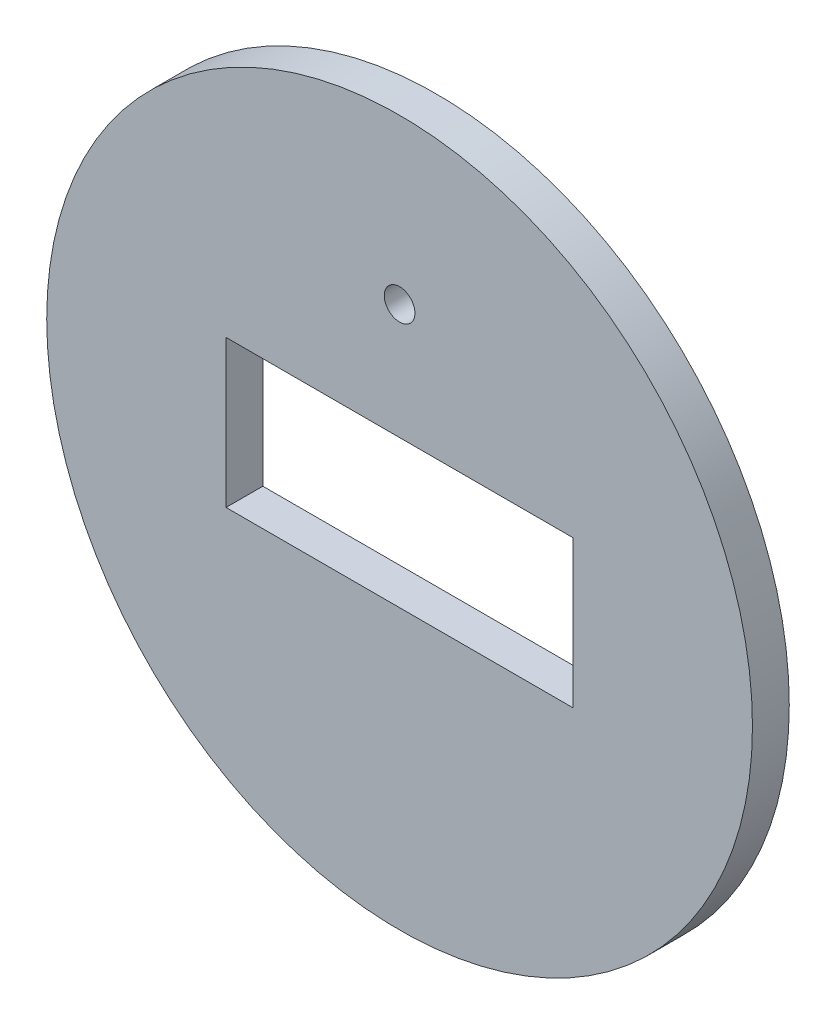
ISO-10303-21;
HEADER;
FILE_DESCRIPTION(('STEP AP214'),'2;1');
FILE_NAME('part.step','',(''),(''),'','','');
FILE_SCHEMA(('AUTOMOTIVE_DESIGN { 1 0 10303 214 1 1 1 1 }'));
ENDSEC;
DATA;
#1=APPLICATION_CONTEXT('core data for automotive mechanical design processes');
#2=APPLICATION_PROTOCOL_DEFINITION('international standard','automotive_design',2000,#1);
#3=PRODUCT_CONTEXT('',#1,'mechanical');
#4=PRODUCT('Part','Part','',(#3));
#5=PRODUCT_RELATED_PRODUCT_CATEGORY('part','',(#4));
#6=PRODUCT_DEFINITION_FORMATION('','',#4);
#7=PRODUCT_DEFINITION_CONTEXT('part definition',#1,'design');
#8=PRODUCT_DEFINITION('design','',#6,#7);
#9=PRODUCT_DEFINITION_SHAPE('','',#8);
#10=(LENGTH_UNIT() NAMED_UNIT(*) SI_UNIT(.MILLI.,.METRE.));
#11=(NAMED_UNIT(*) PLANE_ANGLE_UNIT() SI_UNIT($,.RADIAN.));
#12=(NAMED_UNIT(*) SI_UNIT($,.STERADIAN.) SOLID_ANGLE_UNIT());
#13=UNCERTAINTY_MEASURE_WITH_UNIT(LENGTH_MEASURE(1.E-05),#10,'distance_accuracy_value','');
#14=(GEOMETRIC_REPRESENTATION_CONTEXT(3) GLOBAL_UNCERTAINTY_ASSIGNED_CONTEXT((#13)) GLOBAL_UNIT_ASSIGNED_CONTEXT((#10,
#11,#12)) REPRESENTATION_CONTEXT('',''));
#15=CARTESIAN_POINT('',(0.,0.,0.));
#16=DIRECTION('',(0.,0.,1.));
#17=DIRECTION('',(1.,0.,0.));
#18=AXIS2_PLACEMENT_3D('',#15,#16,#17);
#19=CARTESIAN_POINT('',(0.,0.,3.81));
#20=DIRECTION('',(0.,0.,1.));
#21=DIRECTION('',(1.,0.,0.));
#22=AXIS2_PLACEMENT_3D('',#19,#20,#21);
#23=PLANE('',#22);
#24=CARTESIAN_POINT('',(0.,19.558,3.81));
#25=DIRECTION('',(0.,0.,1.));
#26=DIRECTION('',(1.,0.,0.));
#27=AXIS2_PLACEMENT_3D('',#24,#25,#26);
#28=CIRCLE('',#27,1.5875);
#29=CARTESIAN_POINT('',(-1.5875,19.558,3.81));
#30=VERTEX_POINT('',#29);
#31=EDGE_CURVE('E110',#30,#30,#28,.T.);
#32=ORIENTED_EDGE('',*,*,#31,.F.);
#33=EDGE_LOOP('',(#32));
#34=FACE_BOUND('',#33,.T.);
#35=CARTESIAN_POINT('',(0.,0.,3.81));
#36=DIRECTION('',(0.,0.,1.));
#37=DIRECTION('',(1.,0.,0.));
#38=AXIS2_PLACEMENT_3D('',#35,#36,#37);
#39=CIRCLE('',#38,36.5125);
#40=CARTESIAN_POINT('',(-36.5125,0.,3.81));
#41=VERTEX_POINT('',#40);
#42=EDGE_CURVE('E11',#41,#41,#39,.T.);
#43=ORIENTED_EDGE('',*,*,#42,.T.);
#44=EDGE_LOOP('',(#43));
#45=FACE_BOUND('',#44,.T.);
#46=DIRECTION('',(1.,0.,0.));
#47=VECTOR('',#46,1.);
#48=CARTESIAN_POINT('',(17.9578,-7.62,3.81));
#49=LINE('',#48,#47);
#50=CARTESIAN_POINT('',(-17.9578,-7.62,3.81));
#51=VERTEX_POINT('',#50);
#52=CARTESIAN_POINT('',(17.9578,-7.62,3.81));
#53=VERTEX_POINT('',#52);
#54=EDGE_CURVE('E98',#51,#53,#49,.T.);
#55=ORIENTED_EDGE('',*,*,#54,.F.);
#56=DIRECTION('',(0.,-1.,0.));
#57=VECTOR('',#56,1.);
#58=CARTESIAN_POINT('',(-17.9578,7.62,3.81));
#59=LINE('',#58,#57);
#60=CARTESIAN_POINT('',(-17.9578,7.62,3.81));
#61=VERTEX_POINT('',#60);
#62=EDGE_CURVE('E87',#61,#51,#59,.T.);
#63=ORIENTED_EDGE('',*,*,#62,.F.);
#64=DIRECTION('',(-1.,0.,0.));
#65=VECTOR('',#64,1.);
#66=CARTESIAN_POINT('',(-17.9578,7.62,3.81));
#67=LINE('',#66,#65);
#68=CARTESIAN_POINT('',(17.9578,7.62,3.81));
#69=VERTEX_POINT('',#68);
#70=EDGE_CURVE('E102',#69,#61,#67,.T.);
#71=ORIENTED_EDGE('',*,*,#70,.F.);
#72=DIRECTION('',(0.,1.,0.));
#73=VECTOR('',#72,1.);
#74=CARTESIAN_POINT('',(17.9578,7.62,3.81));
#75=LINE('',#74,#73);
#76=EDGE_CURVE('E100',#53,#69,#75,.T.);
#77=ORIENTED_EDGE('',*,*,#76,.F.);
#78=EDGE_LOOP('',(#55,#63,#71,#77));
#79=FACE_BOUND('',#78,.T.);
#80=ADVANCED_FACE('F31',(#34,#45,#79),#23,.T.);
#81=CARTESIAN_POINT('',(0.,0.,0.));
#82=DIRECTION('',(0.,0.,1.));
#83=DIRECTION('',(1.,0.,0.));
#84=AXIS2_PLACEMENT_3D('',#81,#82,#83);
#85=PLANE('',#84);
#86=CARTESIAN_POINT('',(0.,19.558,0.));
#87=DIRECTION('',(0.,0.,1.));
#88=DIRECTION('',(1.,0.,0.));
#89=AXIS2_PLACEMENT_3D('',#86,#87,#88);
#90=CIRCLE('',#89,1.5875);
#91=CARTESIAN_POINT('',(-1.5875,19.558,0.));
#92=VERTEX_POINT('',#91);
#93=EDGE_CURVE('E88',#92,#92,#90,.T.);
#94=ORIENTED_EDGE('',*,*,#93,.T.);
#95=EDGE_LOOP('',(#94));
#96=FACE_BOUND('',#95,.T.);
#97=CARTESIAN_POINT('',(0.,0.,0.));
#98=DIRECTION('',(0.,0.,1.));
#99=DIRECTION('',(1.,0.,0.));
#100=AXIS2_PLACEMENT_3D('',#97,#98,#99);
#101=CIRCLE('',#100,36.5125);
#102=CARTESIAN_POINT('',(-36.5125,0.,0.));
#103=VERTEX_POINT('',#102);
#104=EDGE_CURVE('E39',#103,#103,#101,.T.);
#105=ORIENTED_EDGE('',*,*,#104,.F.);
#106=EDGE_LOOP('',(#105));
#107=FACE_BOUND('',#106,.T.);
#108=DIRECTION('',(0.,-1.,0.));
#109=VECTOR('',#108,1.);
#110=CARTESIAN_POINT('',(-17.9578,7.62,0.));
#111=LINE('',#110,#109);
#112=CARTESIAN_POINT('',(-17.9578,7.62,0.));
#113=VERTEX_POINT('',#112);
#114=CARTESIAN_POINT('',(-17.9578,-7.62,0.));
#115=VERTEX_POINT('',#114);
#116=EDGE_CURVE('E54',#113,#115,#111,.T.);
#117=ORIENTED_EDGE('',*,*,#116,.T.);
#118=DIRECTION('',(1.,0.,0.));
#119=VECTOR('',#118,1.);
#120=CARTESIAN_POINT('',(17.9578,-7.62,0.));
#121=LINE('',#120,#119);
#122=CARTESIAN_POINT('',(17.9578,-7.62,0.));
#123=VERTEX_POINT('',#122);
#124=EDGE_CURVE('E74',#115,#123,#121,.T.);
#125=ORIENTED_EDGE('',*,*,#124,.T.);
#126=DIRECTION('',(0.,1.,0.));
#127=VECTOR('',#126,1.);
#128=CARTESIAN_POINT('',(17.9578,7.62,0.));
#129=LINE('',#128,#127);
#130=CARTESIAN_POINT('',(17.9578,7.62,0.));
#131=VERTEX_POINT('',#130);
#132=EDGE_CURVE('E83',#123,#131,#129,.T.);
#133=ORIENTED_EDGE('',*,*,#132,.T.);
#134=DIRECTION('',(-1.,0.,0.));
#135=VECTOR('',#134,1.);
#136=CARTESIAN_POINT('',(-17.9578,7.62,0.));
#137=LINE('',#136,#135);
#138=EDGE_CURVE('E92',#131,#113,#137,.T.);
#139=ORIENTED_EDGE('',*,*,#138,.T.);
#140=EDGE_LOOP('',(#117,#125,#133,#139));
#141=FACE_BOUND('',#140,.T.);
#142=ADVANCED_FACE('F91',(#96,#107,#141),#85,.F.);
#143=CARTESIAN_POINT('',(0.,0.,3.81));
#144=DIRECTION('',(0.,0.,-1.));
#145=DIRECTION('',(-1.,0.,0.));
#146=AXIS2_PLACEMENT_3D('',#143,#144,#145);
#147=CYLINDRICAL_SURFACE('',#146,36.5125);
#148=CARTESIAN_POINT('',(-36.5125,0.,3.81));
#149=CARTESIAN_POINT('',(-36.5125,0.,3.7703125));
#150=CARTESIAN_POINT('',(-36.5125,0.,3.730625));
#151=CARTESIAN_POINT('',(-36.5125,0.,3.65125));
#152=CARTESIAN_POINT('',(-36.5125,0.,3.6115625));
#153=CARTESIAN_POINT('',(-36.5125,0.,3.5321875));
#154=CARTESIAN_POINT('',(-36.5125,0.,3.4925));
#155=CARTESIAN_POINT('',(-36.5125,0.,3.413125));
#156=CARTESIAN_POINT('',(-36.5125,0.,3.3734375));
#157=CARTESIAN_POINT('',(-36.5125,0.,3.2940625));
#158=CARTESIAN_POINT('',(-36.5125,0.,3.254375));
#159=CARTESIAN_POINT('',(-36.5125,0.,3.175));
#160=CARTESIAN_POINT('',(-36.5125,0.,3.1353125));
#161=CARTESIAN_POINT('',(-36.5125,0.,3.0559375));
#162=CARTESIAN_POINT('',(-36.5125,0.,3.01625));
#163=CARTESIAN_POINT('',(-36.5125,0.,2.936875));
#164=CARTESIAN_POINT('',(-36.5125,0.,2.8971875));
#165=CARTESIAN_POINT('',(-36.5125,0.,2.8178125));
#166=CARTESIAN_POINT('',(-36.5125,0.,2.778125));
#167=CARTESIAN_POINT('',(-36.5125,0.,2.69875));
#168=CARTESIAN_POINT('',(-36.5125,0.,2.6590625));
#169=CARTESIAN_POINT('',(-36.5125,0.,2.5796875));
#170=CARTESIAN_POINT('',(-36.5125,0.,2.54));
#171=CARTESIAN_POINT('',(-36.5125,0.,2.460625));
#172=CARTESIAN_POINT('',(-36.5125,0.,2.4209375));
#173=CARTESIAN_POINT('',(-36.5125,0.,2.3415625));
#174=CARTESIAN_POINT('',(-36.5125,0.,2.301875));
#175=CARTESIAN_POINT('',(-36.5125,0.,2.2225));
#176=CARTESIAN_POINT('',(-36.5125,0.,2.1828125));
#177=CARTESIAN_POINT('',(-36.5125,0.,2.1034375));
#178=CARTESIAN_POINT('',(-36.5125,0.,2.06375));
#179=CARTESIAN_POINT('',(-36.5125,0.,1.984375));
#180=CARTESIAN_POINT('',(-36.5125,0.,1.9446875));
#181=CARTESIAN_POINT('',(-36.5125,0.,1.8653125));
#182=CARTESIAN_POINT('',(-36.5125,0.,1.825625));
#183=CARTESIAN_POINT('',(-36.5125,0.,1.74625));
#184=CARTESIAN_POINT('',(-36.5125,0.,1.7065625));
#185=CARTESIAN_POINT('',(-36.5125,0.,1.6271875));
#186=CARTESIAN_POINT('',(-36.5125,0.,1.5875));
#187=CARTESIAN_POINT('',(-36.5125,0.,1.508125));
#188=CARTESIAN_POINT('',(-36.5125,0.,1.4684375));
#189=CARTESIAN_POINT('',(-36.5125,0.,1.3890625));
#190=CARTESIAN_POINT('',(-36.5125,0.,1.349375));
#191=CARTESIAN_POINT('',(-36.5125,0.,1.27));
#192=CARTESIAN_POINT('',(-36.5125,0.,1.2303125));
#193=CARTESIAN_POINT('',(-36.5125,0.,1.1509375));
#194=CARTESIAN_POINT('',(-36.5125,0.,1.11125));
#195=CARTESIAN_POINT('',(-36.5125,0.,1.031875));
#196=CARTESIAN_POINT('',(-36.5125,0.,0.9921875));
#197=CARTESIAN_POINT('',(-36.5125,0.,0.9128125));
#198=CARTESIAN_POINT('',(-36.5125,0.,0.873125));
#199=CARTESIAN_POINT('',(-36.5125,0.,0.79375));
#200=CARTESIAN_POINT('',(-36.5125,0.,0.7540625));
#201=CARTESIAN_POINT('',(-36.5125,0.,0.6746875));
#202=CARTESIAN_POINT('',(-36.5125,0.,0.635));
#203=CARTESIAN_POINT('',(-36.5125,0.,0.555625));
#204=CARTESIAN_POINT('',(-36.5125,0.,0.5159375));
#205=CARTESIAN_POINT('',(-36.5125,0.,0.4365625));
#206=CARTESIAN_POINT('',(-36.5125,0.,0.396875));
#207=CARTESIAN_POINT('',(-36.5125,0.,0.3175));
#208=CARTESIAN_POINT('',(-36.5125,0.,0.2778125));
#209=CARTESIAN_POINT('',(-36.5125,0.,0.1984375));
#210=CARTESIAN_POINT('',(-36.5125,0.,0.15875));
#211=CARTESIAN_POINT('',(-36.5125,0.,0.0793749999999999));
#212=CARTESIAN_POINT('',(-36.5125,0.,0.0396874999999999));
#213=CARTESIAN_POINT('',(-36.5125,0.,0.));
#214=B_SPLINE_CURVE_WITH_KNOTS('',3,(#148,#149,#150,#151,#152,#153,#154,#155,#156,#157,#158,
#159,#160,#161,#162,#163,#164,#165,#166,#167,#168,#169,#170,#171,#172,#173,#174,#175,#176,#177,
#178,#179,#180,#181,#182,#183,#184,#185,#186,#187,#188,#189,#190,#191,#192,#193,#194,#195,#196,
#197,#198,#199,#200,#201,#202,#203,#204,#205,#206,#207,#208,#209,#210,#211,#212,#213),
.UNSPECIFIED.,.F.,.F.,(4,2,2,2,2,2,2,2,2,2,2,2,2,2,2,2,2,2,2,2,2,2,2,2,2,2,2,2,2,2,2,2,4),(0.,
0.1190625,0.238125,0.3571875,0.47625,0.5953125,0.714375,0.8334375,0.9525,1.0715625,1.190625,
1.3096875,1.42875,1.5478125,1.666875,1.7859375,1.905,2.0240625,2.143125,2.2621875,2.38125,
2.5003125,2.619375,2.7384375,2.8575,2.9765625,3.095625,3.2146875,3.33375,3.4528125,3.571875,
3.6909375,3.81),.UNSPECIFIED.);
#215=EDGE_CURVE('BSEAM33',#41,#103,#214,.T.);
#216=ORIENTED_EDGE('',*,*,#42,.F.);
#217=ORIENTED_EDGE('',*,*,#104,.T.);
#218=ORIENTED_EDGE('',*,*,#215,.T.);
#219=ORIENTED_EDGE('',*,*,#215,.F.);
#220=EDGE_LOOP('',(#216,#218,#217,#219));
#221=FACE_BOUND('',#220,.T.);
#222=ADVANCED_FACE('F33',(#221),#147,.T.);
#223=CARTESIAN_POINT('',(0.,19.558,3.81));
#224=DIRECTION('',(0.,0.,-1.));
#225=DIRECTION('',(-1.,0.,0.));
#226=AXIS2_PLACEMENT_3D('',#223,#224,#225);
#227=CYLINDRICAL_SURFACE('',#226,1.5875);
#228=CARTESIAN_POINT('',(-1.5875,19.558,3.81));
#229=CARTESIAN_POINT('',(-1.5875,19.558,3.7703125));
#230=CARTESIAN_POINT('',(-1.5875,19.558,3.730625));
#231=CARTESIAN_POINT('',(-1.5875,19.558,3.65125));
#232=CARTESIAN_POINT('',(-1.5875,19.558,3.6115625));
#233=CARTESIAN_POINT('',(-1.5875,19.558,3.5321875));
#234=CARTESIAN_POINT('',(-1.5875,19.558,3.4925));
#235=CARTESIAN_POINT('',(-1.5875,19.558,3.413125));
#236=CARTESIAN_POINT('',(-1.5875,19.558,3.3734375));
#237=CARTESIAN_POINT('',(-1.5875,19.558,3.2940625));
#238=CARTESIAN_POINT('',(-1.5875,19.558,3.254375));
#239=CARTESIAN_POINT('',(-1.5875,19.558,3.175));
#240=CARTESIAN_POINT('',(-1.5875,19.558,3.1353125));
#241=CARTESIAN_POINT('',(-1.5875,19.558,3.0559375));
#242=CARTESIAN_POINT('',(-1.5875,19.558,3.01625));
#243=CARTESIAN_POINT('',(-1.5875,19.558,2.936875));
#244=CARTESIAN_POINT('',(-1.5875,19.558,2.8971875));
#245=CARTESIAN_POINT('',(-1.5875,19.558,2.8178125));
#246=CARTESIAN_POINT('',(-1.5875,19.558,2.778125));
#247=CARTESIAN_POINT('',(-1.5875,19.558,2.69875));
#248=CARTESIAN_POINT('',(-1.5875,19.558,2.6590625));
#249=CARTESIAN_POINT('',(-1.5875,19.558,2.5796875));
#250=CARTESIAN_POINT('',(-1.5875,19.558,2.54));
#251=CARTESIAN_POINT('',(-1.5875,19.558,2.460625));
#252=CARTESIAN_POINT('',(-1.5875,19.558,2.4209375));
#253=CARTESIAN_POINT('',(-1.5875,19.558,2.3415625));
#254=CARTESIAN_POINT('',(-1.5875,19.558,2.301875));
#255=CARTESIAN_POINT('',(-1.5875,19.558,2.2225));
#256=CARTESIAN_POINT('',(-1.5875,19.558,2.1828125));
#257=CARTESIAN_POINT('',(-1.5875,19.558,2.1034375));
#258=CARTESIAN_POINT('',(-1.5875,19.558,2.06375));
#259=CARTESIAN_POINT('',(-1.5875,19.558,1.984375));
#260=CARTESIAN_POINT('',(-1.5875,19.558,1.9446875));
#261=CARTESIAN_POINT('',(-1.5875,19.558,1.8653125));
#262=CARTESIAN_POINT('',(-1.5875,19.558,1.825625));
#263=CARTESIAN_POINT('',(-1.5875,19.558,1.74625));
#264=CARTESIAN_POINT('',(-1.5875,19.558,1.7065625));
#265=CARTESIAN_POINT('',(-1.5875,19.558,1.6271875));
#266=CARTESIAN_POINT('',(-1.5875,19.558,1.5875));
#267=CARTESIAN_POINT('',(-1.5875,19.558,1.508125));
#268=CARTESIAN_POINT('',(-1.5875,19.558,1.4684375));
#269=CARTESIAN_POINT('',(-1.5875,19.558,1.3890625));
#270=CARTESIAN_POINT('',(-1.5875,19.558,1.349375));
#271=CARTESIAN_POINT('',(-1.5875,19.558,1.27));
#272=CARTESIAN_POINT('',(-1.5875,19.558,1.2303125));
#273=CARTESIAN_POINT('',(-1.5875,19.558,1.1509375));
#274=CARTESIAN_POINT('',(-1.5875,19.558,1.11125));
#275=CARTESIAN_POINT('',(-1.5875,19.558,1.031875));
#276=CARTESIAN_POINT('',(-1.5875,19.558,0.9921875));
#277=CARTESIAN_POINT('',(-1.5875,19.558,0.9128125));
#278=CARTESIAN_POINT('',(-1.5875,19.558,0.873125));
#279=CARTESIAN_POINT('',(-1.5875,19.558,0.79375));
#280=CARTESIAN_POINT('',(-1.5875,19.558,0.7540625));
#281=CARTESIAN_POINT('',(-1.5875,19.558,0.6746875));
#282=CARTESIAN_POINT('',(-1.5875,19.558,0.635));
#283=CARTESIAN_POINT('',(-1.5875,19.558,0.555625));
#284=CARTESIAN_POINT('',(-1.5875,19.558,0.5159375));
#285=CARTESIAN_POINT('',(-1.5875,19.558,0.4365625));
#286=CARTESIAN_POINT('',(-1.5875,19.558,0.396875));
#287=CARTESIAN_POINT('',(-1.5875,19.558,0.3175));
#288=CARTESIAN_POINT('',(-1.5875,19.558,0.2778125));
#289=CARTESIAN_POINT('',(-1.5875,19.558,0.1984375));
#290=CARTESIAN_POINT('',(-1.5875,19.558,0.15875));
#291=CARTESIAN_POINT('',(-1.5875,19.558,0.0793749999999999));
#292=CARTESIAN_POINT('',(-1.5875,19.558,0.0396874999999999));
#293=CARTESIAN_POINT('',(-1.5875,19.558,0.));
#294=B_SPLINE_CURVE_WITH_KNOTS('',3,(#228,#229,#230,#231,#232,#233,#234,#235,#236,#237,#238,
#239,#240,#241,#242,#243,#244,#245,#246,#247,#248,#249,#250,#251,#252,#253,#254,#255,#256,#257,
#258,#259,#260,#261,#262,#263,#264,#265,#266,#267,#268,#269,#270,#271,#272,#273,#274,#275,#276,
#277,#278,#279,#280,#281,#282,#283,#284,#285,#286,#287,#288,#289,#290,#291,#292,#293),
.UNSPECIFIED.,.F.,.F.,(4,2,2,2,2,2,2,2,2,2,2,2,2,2,2,2,2,2,2,2,2,2,2,2,2,2,2,2,2,2,2,2,4),(0.,
0.1190625,0.238125,0.3571875,0.47625,0.5953125,0.714375,0.8334375,0.9525,1.0715625,1.190625,
1.3096875,1.42875,1.5478125,1.666875,1.7859375,1.905,2.0240625,2.143125,2.2621875,2.38125,
2.5003125,2.619375,2.7384375,2.8575,2.9765625,3.095625,3.2146875,3.33375,3.4528125,3.571875,
3.6909375,3.81),.UNSPECIFIED.);
#295=EDGE_CURVE('BSEAM123',#30,#92,#294,.T.);
#296=ORIENTED_EDGE('',*,*,#31,.T.);
#297=ORIENTED_EDGE('',*,*,#93,.F.);
#298=ORIENTED_EDGE('',*,*,#295,.T.);
#299=ORIENTED_EDGE('',*,*,#295,.F.);
#300=EDGE_LOOP('',(#296,#298,#297,#299));
#301=FACE_BOUND('',#300,.T.);
#302=ADVANCED_FACE('F123',(#301),#227,.F.);
#303=CARTESIAN_POINT('',(-17.9578,7.62,3.81));
#304=DIRECTION('',(1.,0.,0.));
#305=DIRECTION('',(0.,1.,0.));
#306=AXIS2_PLACEMENT_3D('',#303,#304,#305);
#307=PLANE('',#306);
#308=ORIENTED_EDGE('',*,*,#116,.F.);
#309=DIRECTION('',(0.,0.,-1.));
#310=VECTOR('',#309,1.);
#311=CARTESIAN_POINT('',(-17.9578,7.62,3.81));
#312=LINE('',#311,#310);
#313=EDGE_CURVE('E104',#61,#113,#312,.T.);
#314=ORIENTED_EDGE('',*,*,#313,.F.);
#315=ORIENTED_EDGE('',*,*,#62,.T.);
#316=DIRECTION('',(0.,0.,-1.));
#317=VECTOR('',#316,1.);
#318=CARTESIAN_POINT('',(-17.9578,-7.62,3.81));
#319=LINE('',#318,#317);
#320=EDGE_CURVE('E76',#51,#115,#319,.T.);
#321=ORIENTED_EDGE('',*,*,#320,.T.);
#322=EDGE_LOOP('',(#308,#314,#315,#321));
#323=FACE_BOUND('',#322,.T.);
#324=ADVANCED_FACE('F85',(#323),#307,.T.);
#325=CARTESIAN_POINT('',(17.9578,-7.62,3.81));
#326=DIRECTION('',(0.,1.,0.));
#327=DIRECTION('',(0.,0.,1.));
#328=AXIS2_PLACEMENT_3D('',#325,#326,#327);
#329=PLANE('',#328);
#330=ORIENTED_EDGE('',*,*,#124,.F.);
#331=ORIENTED_EDGE('',*,*,#320,.F.);
#332=ORIENTED_EDGE('',*,*,#54,.T.);
#333=DIRECTION('',(0.,0.,-1.));
#334=VECTOR('',#333,1.);
#335=CARTESIAN_POINT('',(17.9578,-7.62,3.81));
#336=LINE('',#335,#334);
#337=EDGE_CURVE('E79',#53,#123,#336,.T.);
#338=ORIENTED_EDGE('',*,*,#337,.T.);
#339=EDGE_LOOP('',(#330,#331,#332,#338));
#340=FACE_BOUND('',#339,.T.);
#341=ADVANCED_FACE('F75',(#340),#329,.T.);
#342=CARTESIAN_POINT('',(17.9578,7.62,3.81));
#343=DIRECTION('',(-1.,0.,0.));
#344=DIRECTION('',(0.,0.,1.));
#345=AXIS2_PLACEMENT_3D('',#342,#343,#344);
#346=PLANE('',#345);
#347=ORIENTED_EDGE('',*,*,#132,.F.);
#348=ORIENTED_EDGE('',*,*,#337,.F.);
#349=ORIENTED_EDGE('',*,*,#76,.T.);
#350=DIRECTION('',(0.,0.,-1.));
#351=VECTOR('',#350,1.);
#352=CARTESIAN_POINT('',(17.9578,7.62,3.81));
#353=LINE('',#352,#351);
#354=EDGE_CURVE('E46',#69,#131,#353,.T.);
#355=ORIENTED_EDGE('',*,*,#354,.T.);
#356=EDGE_LOOP('',(#347,#348,#349,#355));
#357=FACE_BOUND('',#356,.T.);
#358=ADVANCED_FACE('F134',(#357),#346,.T.);
#359=CARTESIAN_POINT('',(-17.9578,7.62,3.81));
#360=DIRECTION('',(0.,-1.,0.));
#361=DIRECTION('',(0.,0.,-1.));
#362=AXIS2_PLACEMENT_3D('',#359,#360,#361);
#363=PLANE('',#362);
#364=ORIENTED_EDGE('',*,*,#138,.F.);
#365=ORIENTED_EDGE('',*,*,#354,.F.);
#366=ORIENTED_EDGE('',*,*,#70,.T.);
#367=ORIENTED_EDGE('',*,*,#313,.T.);
#368=EDGE_LOOP('',(#364,#365,#366,#367));
#369=FACE_BOUND('',#368,.T.);
#370=ADVANCED_FACE('F137',(#369),#363,.T.);
#371=CLOSED_SHELL('',(#80,#142,#222,#302,#324,#341,#358,#370));
#372=MANIFOLD_SOLID_BREP('B2',#371);
#373=ADVANCED_BREP_SHAPE_REPRESENTATION('',(#18,#372),#14);
#374=SHAPE_DEFINITION_REPRESENTATION(#9,#373);
ENDSEC;
END-ISO-10303-21;
